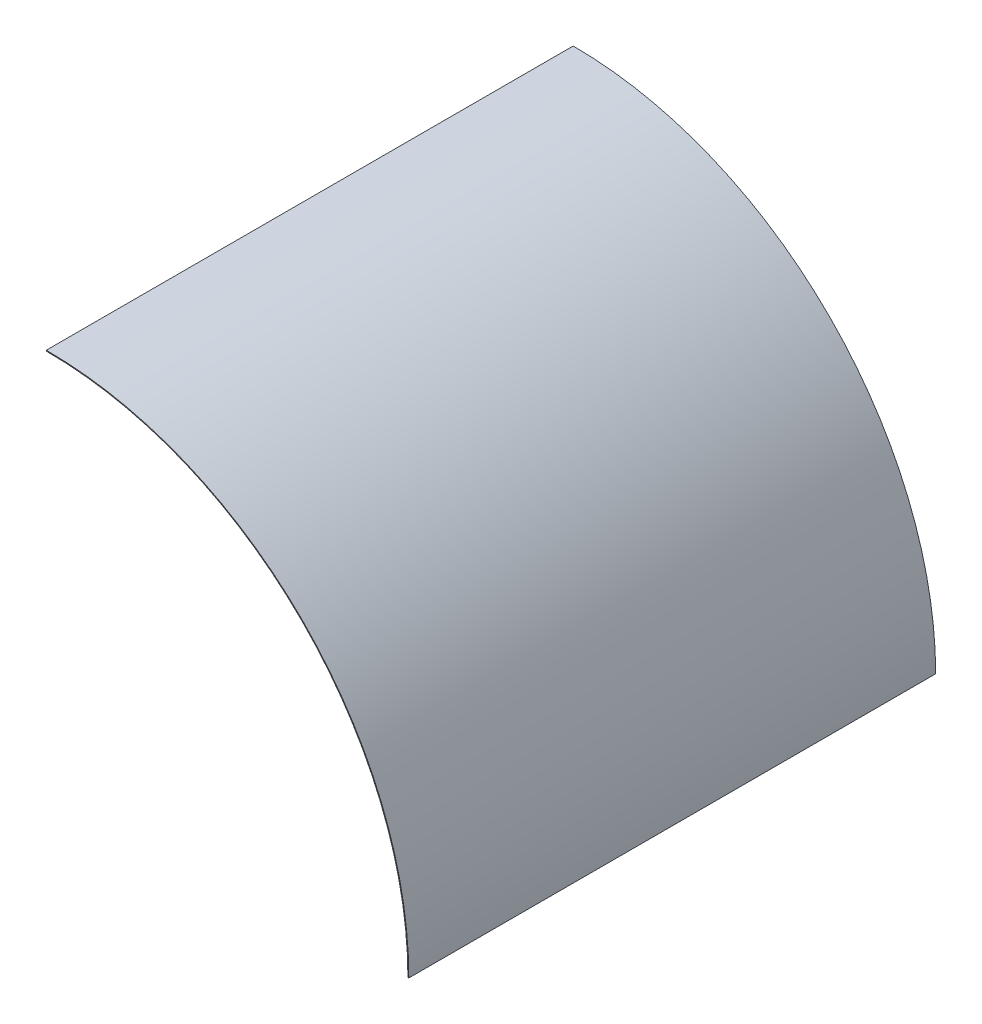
ISO-10303-21;
HEADER;
FILE_DESCRIPTION(('STEP AP214'),'2;1');
FILE_NAME('part.step','',(''),(''),'','','');
FILE_SCHEMA(('AUTOMOTIVE_DESIGN { 1 0 10303 214 1 1 1 1 }'));
ENDSEC;
DATA;
#1=APPLICATION_CONTEXT('core data for automotive mechanical design processes');
#2=APPLICATION_PROTOCOL_DEFINITION('international standard','automotive_design',2000,#1);
#3=PRODUCT_CONTEXT('',#1,'mechanical');
#4=PRODUCT('Part','Part','',(#3));
#5=PRODUCT_RELATED_PRODUCT_CATEGORY('part','',(#4));
#6=PRODUCT_DEFINITION_FORMATION('','',#4);
#7=PRODUCT_DEFINITION_CONTEXT('part definition',#1,'design');
#8=PRODUCT_DEFINITION('design','',#6,#7);
#9=PRODUCT_DEFINITION_SHAPE('','',#8);
#10=(LENGTH_UNIT() NAMED_UNIT(*) SI_UNIT(.MILLI.,.METRE.));
#11=(NAMED_UNIT(*) PLANE_ANGLE_UNIT() SI_UNIT($,.RADIAN.));
#12=(NAMED_UNIT(*) SI_UNIT($,.STERADIAN.) SOLID_ANGLE_UNIT());
#13=UNCERTAINTY_MEASURE_WITH_UNIT(LENGTH_MEASURE(1.E-05),#10,'distance_accuracy_value','');
#14=(GEOMETRIC_REPRESENTATION_CONTEXT(3) GLOBAL_UNCERTAINTY_ASSIGNED_CONTEXT((#13)) GLOBAL_UNIT_ASSIGNED_CONTEXT((#10,
#11,#12)) REPRESENTATION_CONTEXT('',''));
#15=CARTESIAN_POINT('',(0.,0.,0.));
#16=DIRECTION('',(0.,0.,1.));
#17=DIRECTION('',(1.,0.,0.));
#18=AXIS2_PLACEMENT_3D('',#15,#16,#17);
#19=CARTESIAN_POINT('',(0.,0.,-3000.));
#20=DIRECTION('',(0.,0.,1.));
#21=DIRECTION('',(1.,0.,0.));
#22=AXIS2_PLACEMENT_3D('',#19,#20,#21);
#23=CYLINDRICAL_SURFACE('',#22,2059.);
#24=CARTESIAN_POINT('',(0.,0.,0.));
#25=DIRECTION('',(0.,0.,-1.));
#26=DIRECTION('',(-1.,0.,0.));
#27=AXIS2_PLACEMENT_3D('',#24,#25,#26);
#28=CIRCLE('',#27,2059.);
#29=CARTESIAN_POINT('',(0.,2059.,0.));
#30=VERTEX_POINT('',#29);
#31=CARTESIAN_POINT('',(2059.,0.,0.));
#32=VERTEX_POINT('',#31);
#33=EDGE_CURVE('E101',#30,#32,#28,.T.);
#34=ORIENTED_EDGE('',*,*,#33,.F.);
#35=DIRECTION('',(0.,0.,1.));
#36=VECTOR('',#35,1.);
#37=CARTESIAN_POINT('',(0.,2059.,-3000.));
#38=LINE('',#37,#36);
#39=CARTESIAN_POINT('',(0.,2059.,-3000.));
#40=VERTEX_POINT('',#39);
#41=EDGE_CURVE('E11',#40,#30,#38,.T.);
#42=ORIENTED_EDGE('',*,*,#41,.F.);
#43=CARTESIAN_POINT('',(0.,0.,-3000.));
#44=DIRECTION('',(0.,0.,-1.));
#45=DIRECTION('',(-1.,0.,0.));
#46=AXIS2_PLACEMENT_3D('',#43,#44,#45);
#47=CIRCLE('',#46,2059.);
#48=CARTESIAN_POINT('',(2059.,0.,-3000.));
#49=VERTEX_POINT('',#48);
#50=EDGE_CURVE('E95',#40,#49,#47,.T.);
#51=ORIENTED_EDGE('',*,*,#50,.T.);
#52=DIRECTION('',(0.,0.,1.));
#53=VECTOR('',#52,1.);
#54=CARTESIAN_POINT('',(2059.,0.,-3000.));
#55=LINE('',#54,#53);
#56=EDGE_CURVE('E40',#49,#32,#55,.T.);
#57=ORIENTED_EDGE('',*,*,#56,.T.);
#58=EDGE_LOOP('',(#34,#42,#51,#57));
#59=FACE_BOUND('',#58,.T.);
#60=ADVANCED_FACE('F37',(#59),#23,.F.);
#61=CARTESIAN_POINT('',(0.,2064.,-3000.));
#62=DIRECTION('',(-1.,0.,0.));
#63=DIRECTION('',(0.,0.,1.));
#64=AXIS2_PLACEMENT_3D('',#61,#62,#63);
#65=PLANE('',#64);
#66=DIRECTION('',(0.,-1.,0.));
#67=VECTOR('',#66,1.);
#68=CARTESIAN_POINT('',(0.,2064.,0.));
#69=LINE('',#68,#67);
#70=CARTESIAN_POINT('',(0.,2064.,0.));
#71=VERTEX_POINT('',#70);
#72=EDGE_CURVE('E97',#71,#30,#69,.T.);
#73=ORIENTED_EDGE('',*,*,#72,.F.);
#74=DIRECTION('',(0.,0.,1.));
#75=VECTOR('',#74,1.);
#76=CARTESIAN_POINT('',(0.,2064.,-3000.));
#77=LINE('',#76,#75);
#78=CARTESIAN_POINT('',(0.,2064.,-3000.));
#79=VERTEX_POINT('',#78);
#80=EDGE_CURVE('E46',#79,#71,#77,.T.);
#81=ORIENTED_EDGE('',*,*,#80,.F.);
#82=DIRECTION('',(0.,-1.,0.));
#83=VECTOR('',#82,1.);
#84=CARTESIAN_POINT('',(0.,2064.,-3000.));
#85=LINE('',#84,#83);
#86=EDGE_CURVE('E92',#79,#40,#85,.T.);
#87=ORIENTED_EDGE('',*,*,#86,.T.);
#88=ORIENTED_EDGE('',*,*,#41,.T.);
#89=EDGE_LOOP('',(#73,#81,#87,#88));
#90=FACE_BOUND('',#89,.T.);
#91=ADVANCED_FACE('F111',(#90),#65,.T.);
#92=CARTESIAN_POINT('',(0.,0.,-3000.));
#93=DIRECTION('',(0.,0.,1.));
#94=DIRECTION('',(1.,0.,0.));
#95=AXIS2_PLACEMENT_3D('',#92,#93,#94);
#96=CYLINDRICAL_SURFACE('',#95,2064.);
#97=CARTESIAN_POINT('',(0.,0.,0.));
#98=DIRECTION('',(0.,0.,1.));
#99=DIRECTION('',(-1.,0.,0.));
#100=AXIS2_PLACEMENT_3D('',#97,#98,#99);
#101=CIRCLE('',#100,2064.);
#102=CARTESIAN_POINT('',(2064.,2.52767099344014E-13,0.));
#103=VERTEX_POINT('',#102);
#104=EDGE_CURVE('E87',#103,#71,#101,.T.);
#105=ORIENTED_EDGE('',*,*,#104,.F.);
#106=DIRECTION('',(0.,0.,1.));
#107=VECTOR('',#106,1.);
#108=CARTESIAN_POINT('',(2064.,2.52767099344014E-13,-3000.));
#109=LINE('',#108,#107);
#110=CARTESIAN_POINT('',(2064.,2.52767099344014E-13,-3000.));
#111=VERTEX_POINT('',#110);
#112=EDGE_CURVE('E82',#111,#103,#109,.T.);
#113=ORIENTED_EDGE('',*,*,#112,.F.);
#114=CARTESIAN_POINT('',(0.,0.,-3000.));
#115=DIRECTION('',(0.,0.,1.));
#116=DIRECTION('',(-1.,0.,0.));
#117=AXIS2_PLACEMENT_3D('',#114,#115,#116);
#118=CIRCLE('',#117,2064.);
#119=EDGE_CURVE('E85',#111,#79,#118,.T.);
#120=ORIENTED_EDGE('',*,*,#119,.T.);
#121=ORIENTED_EDGE('',*,*,#80,.T.);
#122=EDGE_LOOP('',(#105,#113,#120,#121));
#123=FACE_BOUND('',#122,.T.);
#124=ADVANCED_FACE('F84',(#123),#96,.T.);
#125=CARTESIAN_POINT('',(2064.,0.,-3000.));
#126=DIRECTION('',(0.,-1.,0.));
#127=DIRECTION('',(0.,0.,-1.));
#128=AXIS2_PLACEMENT_3D('',#125,#126,#127);
#129=PLANE('',#128);
#130=DIRECTION('',(1.,0.,0.));
#131=VECTOR('',#130,1.);
#132=CARTESIAN_POINT('',(2064.,0.,0.));
#133=LINE('',#132,#131);
#134=EDGE_CURVE('E104',#32,#103,#133,.T.);
#135=ORIENTED_EDGE('',*,*,#134,.F.);
#136=ORIENTED_EDGE('',*,*,#56,.F.);
#137=DIRECTION('',(1.,0.,0.));
#138=VECTOR('',#137,1.);
#139=CARTESIAN_POINT('',(2064.,0.,-3000.));
#140=LINE('',#139,#138);
#141=EDGE_CURVE('E91',#49,#111,#140,.T.);
#142=ORIENTED_EDGE('',*,*,#141,.T.);
#143=ORIENTED_EDGE('',*,*,#112,.T.);
#144=EDGE_LOOP('',(#135,#136,#142,#143));
#145=FACE_BOUND('',#144,.T.);
#146=ADVANCED_FACE('F94',(#145),#129,.T.);
#147=CARTESIAN_POINT('',(0.,0.,-3000.));
#148=DIRECTION('',(0.,0.,-1.));
#149=DIRECTION('',(-1.,0.,0.));
#150=AXIS2_PLACEMENT_3D('',#147,#148,#149);
#151=PLANE('',#150);
#152=ORIENTED_EDGE('',*,*,#50,.F.);
#153=ORIENTED_EDGE('',*,*,#86,.F.);
#154=ORIENTED_EDGE('',*,*,#119,.F.);
#155=ORIENTED_EDGE('',*,*,#141,.F.);
#156=EDGE_LOOP('',(#152,#153,#154,#155));
#157=FACE_BOUND('',#156,.T.);
#158=ADVANCED_FACE('F90',(#157),#151,.T.);
#159=CARTESIAN_POINT('',(0.,0.,0.));
#160=DIRECTION('',(0.,0.,-1.));
#161=DIRECTION('',(-1.,0.,0.));
#162=AXIS2_PLACEMENT_3D('',#159,#160,#161);
#163=PLANE('',#162);
#164=ORIENTED_EDGE('',*,*,#33,.T.);
#165=ORIENTED_EDGE('',*,*,#134,.T.);
#166=ORIENTED_EDGE('',*,*,#104,.T.);
#167=ORIENTED_EDGE('',*,*,#72,.T.);
#168=EDGE_LOOP('',(#164,#165,#166,#167));
#169=FACE_BOUND('',#168,.T.);
#170=ADVANCED_FACE('F110',(#169),#163,.F.);
#171=CLOSED_SHELL('',(#60,#91,#124,#146,#158,#170));
#172=MANIFOLD_SOLID_BREP('B2',#171);
#173=ADVANCED_BREP_SHAPE_REPRESENTATION('',(#18,#172),#14);
#174=SHAPE_DEFINITION_REPRESENTATION(#9,#173);
ENDSEC;
END-ISO-10303-21;
